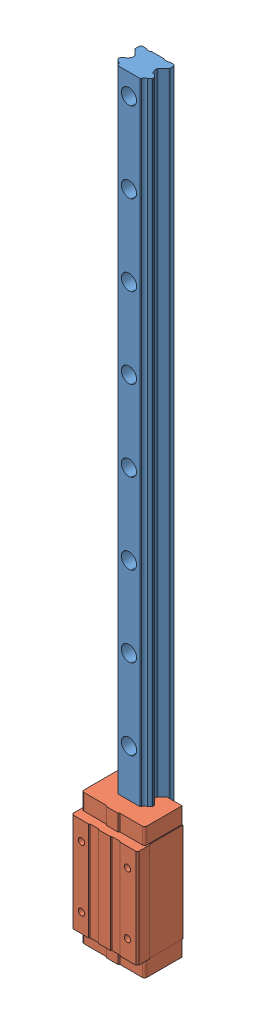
SolidWorks assembly HXH45HA1R1000ZOC+E227.527.5.step.sldasm, configuration 默认 (file format 13000). Lengths in mm.
Overall size (86 1000 70).
2 component instances, 2 part files, 0 mates.
Components (placement in the parent):
- HLR45R1000 E=27.5-1: HLR45R1000 E=27.5.SLDPRT [默认] at origin size (45 1000 38)
- HLH45HA-1: HLH45HA.SLDPRT [默认] at (0 90.6 32) size (86 171.2 60.5)
